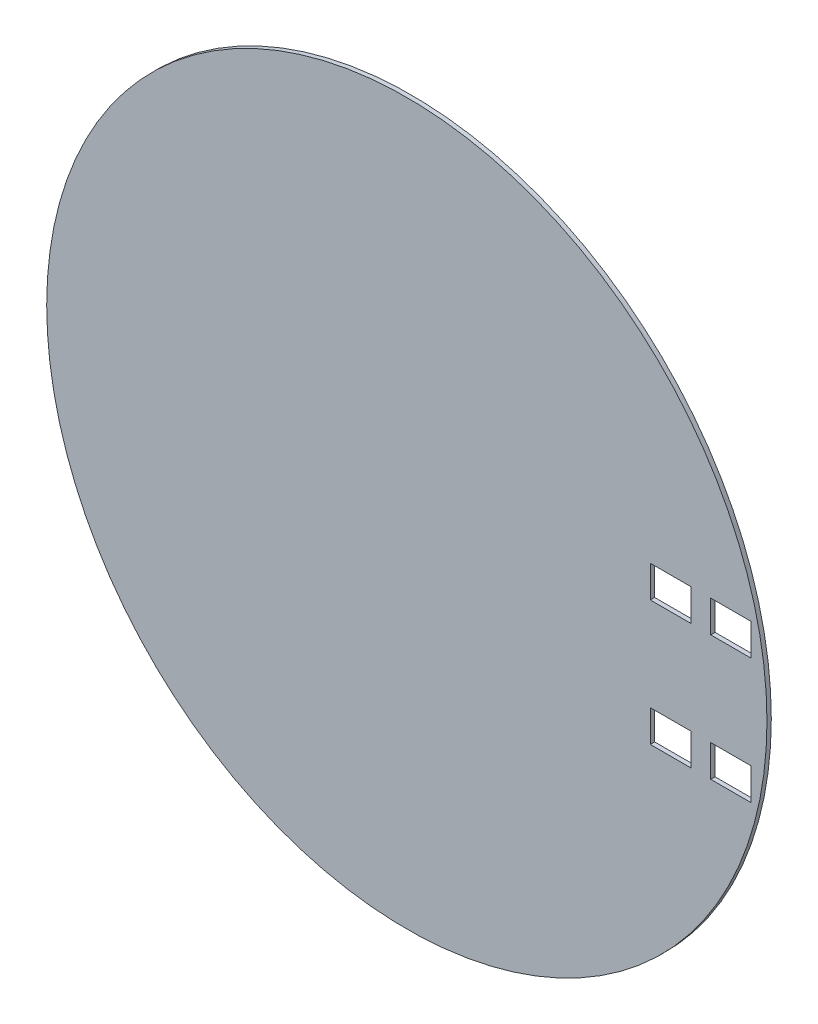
ISO-10303-21;
HEADER;
FILE_DESCRIPTION(('STEP AP214'),'2;1');
FILE_NAME('part.step','',(''),(''),'','','');
FILE_SCHEMA(('AUTOMOTIVE_DESIGN { 1 0 10303 214 1 1 1 1 }'));
ENDSEC;
DATA;
#1=APPLICATION_CONTEXT('core data for automotive mechanical design processes');
#2=APPLICATION_PROTOCOL_DEFINITION('international standard','automotive_design',2000,#1);
#3=PRODUCT_CONTEXT('',#1,'mechanical');
#4=PRODUCT('Part','Part','',(#3));
#5=PRODUCT_RELATED_PRODUCT_CATEGORY('part','',(#4));
#6=PRODUCT_DEFINITION_FORMATION('','',#4);
#7=PRODUCT_DEFINITION_CONTEXT('part definition',#1,'design');
#8=PRODUCT_DEFINITION('design','',#6,#7);
#9=PRODUCT_DEFINITION_SHAPE('','',#8);
#10=(LENGTH_UNIT() NAMED_UNIT(*) SI_UNIT(.MILLI.,.METRE.));
#11=(NAMED_UNIT(*) PLANE_ANGLE_UNIT() SI_UNIT($,.RADIAN.));
#12=(NAMED_UNIT(*) SI_UNIT($,.STERADIAN.) SOLID_ANGLE_UNIT());
#13=UNCERTAINTY_MEASURE_WITH_UNIT(LENGTH_MEASURE(1.E-05),#10,'distance_accuracy_value','');
#14=(GEOMETRIC_REPRESENTATION_CONTEXT(3) GLOBAL_UNCERTAINTY_ASSIGNED_CONTEXT((#13)) GLOBAL_UNIT_ASSIGNED_CONTEXT((#10,
#11,#12)) REPRESENTATION_CONTEXT('',''));
#15=CARTESIAN_POINT('',(0.,0.,0.));
#16=DIRECTION('',(0.,0.,1.));
#17=DIRECTION('',(1.,0.,0.));
#18=AXIS2_PLACEMENT_3D('',#15,#16,#17);
#19=CARTESIAN_POINT('',(0.,0.,1.8));
#20=DIRECTION('',(0.,0.,1.));
#21=DIRECTION('',(1.,0.,0.));
#22=AXIS2_PLACEMENT_3D('',#19,#20,#21);
#23=PLANE('',#22);
#24=CARTESIAN_POINT('',(0.,0.,1.8));
#25=DIRECTION('',(0.,0.,1.));
#26=DIRECTION('',(1.,0.,0.));
#27=AXIS2_PLACEMENT_3D('',#24,#25,#26);
#28=CIRCLE('',#27,24.9);
#29=CARTESIAN_POINT('',(24.9,0.,1.8));
#30=VERTEX_POINT('',#29);
#31=EDGE_CURVE('E244',#30,#30,#28,.T.);
#32=ORIENTED_EDGE('',*,*,#31,.T.);
#33=EDGE_LOOP('',(#32));
#34=FACE_BOUND('',#33,.T.);
#35=DIRECTION('',(-1.,0.,0.));
#36=VECTOR('',#35,1.);
#37=CARTESIAN_POINT('',(0.,-5.4251,1.8));
#38=LINE('',#37,#36);
#39=CARTESIAN_POINT('',(19.632,-5.4251,1.8));
#40=VERTEX_POINT('',#39);
#41=CARTESIAN_POINT('',(16.832,-5.4251,1.8));
#42=VERTEX_POINT('',#41);
#43=EDGE_CURVE('E233',#40,#42,#38,.T.);
#44=ORIENTED_EDGE('',*,*,#43,.T.);
#45=DIRECTION('',(0.,1.,0.));
#46=VECTOR('',#45,1.);
#47=CARTESIAN_POINT('',(16.832,0.,1.8));
#48=LINE('',#47,#46);
#49=CARTESIAN_POINT('',(16.832,-3.2251,1.8));
#50=VERTEX_POINT('',#49);
#51=EDGE_CURVE('E236',#42,#50,#48,.T.);
#52=ORIENTED_EDGE('',*,*,#51,.T.);
#53=DIRECTION('',(1.,0.,0.));
#54=VECTOR('',#53,1.);
#55=CARTESIAN_POINT('',(0.,-3.2251,1.8));
#56=LINE('',#55,#54);
#57=CARTESIAN_POINT('',(19.632,-3.2251,1.8));
#58=VERTEX_POINT('',#57);
#59=EDGE_CURVE('E226',#50,#58,#56,.T.);
#60=ORIENTED_EDGE('',*,*,#59,.T.);
#61=DIRECTION('',(0.,-1.,0.));
#62=VECTOR('',#61,1.);
#63=CARTESIAN_POINT('',(19.632,0.,1.8));
#64=LINE('',#63,#62);
#65=EDGE_CURVE('E234',#58,#40,#64,.T.);
#66=ORIENTED_EDGE('',*,*,#65,.T.);
#67=EDGE_LOOP('',(#44,#52,#60,#66));
#68=FACE_BOUND('',#67,.T.);
#69=DIRECTION('',(-1.,0.,0.));
#70=VECTOR('',#69,1.);
#71=CARTESIAN_POINT('',(0.,3.2251,1.8));
#72=LINE('',#71,#70);
#73=CARTESIAN_POINT('',(19.632,3.2251,1.8));
#74=VERTEX_POINT('',#73);
#75=CARTESIAN_POINT('',(16.832,3.2251,1.8));
#76=VERTEX_POINT('',#75);
#77=EDGE_CURVE('E215',#74,#76,#72,.T.);
#78=ORIENTED_EDGE('',*,*,#77,.T.);
#79=DIRECTION('',(0.,1.,0.));
#80=VECTOR('',#79,1.);
#81=CARTESIAN_POINT('',(16.832,0.,1.8));
#82=LINE('',#81,#80);
#83=CARTESIAN_POINT('',(16.832,5.4251,1.8));
#84=VERTEX_POINT('',#83);
#85=EDGE_CURVE('E214',#76,#84,#82,.T.);
#86=ORIENTED_EDGE('',*,*,#85,.T.);
#87=DIRECTION('',(1.,0.,0.));
#88=VECTOR('',#87,1.);
#89=CARTESIAN_POINT('',(0.,5.4251,1.8));
#90=LINE('',#89,#88);
#91=CARTESIAN_POINT('',(19.632,5.4251,1.8));
#92=VERTEX_POINT('',#91);
#93=EDGE_CURVE('E206',#84,#92,#90,.T.);
#94=ORIENTED_EDGE('',*,*,#93,.T.);
#95=DIRECTION('',(0.,-1.,0.));
#96=VECTOR('',#95,1.);
#97=CARTESIAN_POINT('',(19.632,0.,1.8));
#98=LINE('',#97,#96);
#99=EDGE_CURVE('E207',#92,#74,#98,.T.);
#100=ORIENTED_EDGE('',*,*,#99,.T.);
#101=EDGE_LOOP('',(#78,#86,#94,#100));
#102=FACE_BOUND('',#101,.T.);
#103=DIRECTION('',(-1.,0.,0.));
#104=VECTOR('',#103,1.);
#105=CARTESIAN_POINT('',(0.,-5.4251,1.8));
#106=LINE('',#105,#104);
#107=CARTESIAN_POINT('',(23.8118,-5.4251,1.8));
#108=VERTEX_POINT('',#107);
#109=CARTESIAN_POINT('',(21.0118,-5.4251,1.8));
#110=VERTEX_POINT('',#109);
#111=EDGE_CURVE('E186',#108,#110,#106,.T.);
#112=ORIENTED_EDGE('',*,*,#111,.T.);
#113=DIRECTION('',(0.,1.,0.));
#114=VECTOR('',#113,1.);
#115=CARTESIAN_POINT('',(21.0118,0.,1.8));
#116=LINE('',#115,#114);
#117=CARTESIAN_POINT('',(21.0118,-3.2251,1.8));
#118=VERTEX_POINT('',#117);
#119=EDGE_CURVE('E194',#110,#118,#116,.T.);
#120=ORIENTED_EDGE('',*,*,#119,.T.);
#121=DIRECTION('',(1.,0.,0.));
#122=VECTOR('',#121,1.);
#123=CARTESIAN_POINT('',(0.,-3.2251,1.8));
#124=LINE('',#123,#122);
#125=CARTESIAN_POINT('',(23.8118,-3.2251,1.8));
#126=VERTEX_POINT('',#125);
#127=EDGE_CURVE('E181',#118,#126,#124,.T.);
#128=ORIENTED_EDGE('',*,*,#127,.T.);
#129=DIRECTION('',(0.,-1.,0.));
#130=VECTOR('',#129,1.);
#131=CARTESIAN_POINT('',(23.8118,0.,1.8));
#132=LINE('',#131,#130);
#133=EDGE_CURVE('E187',#126,#108,#132,.T.);
#134=ORIENTED_EDGE('',*,*,#133,.T.);
#135=EDGE_LOOP('',(#112,#120,#128,#134));
#136=FACE_BOUND('',#135,.T.);
#137=DIRECTION('',(-1.,0.,0.));
#138=VECTOR('',#137,1.);
#139=CARTESIAN_POINT('',(0.,3.2251,1.8));
#140=LINE('',#139,#138);
#141=CARTESIAN_POINT('',(23.8118,3.2251,1.8));
#142=VERTEX_POINT('',#141);
#143=CARTESIAN_POINT('',(21.0118,3.2251,1.8));
#144=VERTEX_POINT('',#143);
#145=EDGE_CURVE('E170',#142,#144,#140,.T.);
#146=ORIENTED_EDGE('',*,*,#145,.T.);
#147=DIRECTION('',(0.,1.,0.));
#148=VECTOR('',#147,1.);
#149=CARTESIAN_POINT('',(21.0118,0.,1.8));
#150=LINE('',#149,#148);
#151=CARTESIAN_POINT('',(21.0118,5.4251,1.8));
#152=VERTEX_POINT('',#151);
#153=EDGE_CURVE('E161',#144,#152,#150,.T.);
#154=ORIENTED_EDGE('',*,*,#153,.T.);
#155=DIRECTION('',(1.,0.,0.));
#156=VECTOR('',#155,1.);
#157=CARTESIAN_POINT('',(0.,5.4251,1.8));
#158=LINE('',#157,#156);
#159=CARTESIAN_POINT('',(23.8118,5.4251,1.8));
#160=VERTEX_POINT('',#159);
#161=EDGE_CURVE('E147',#152,#160,#158,.T.);
#162=ORIENTED_EDGE('',*,*,#161,.T.);
#163=DIRECTION('',(0.,-1.,0.));
#164=VECTOR('',#163,1.);
#165=CARTESIAN_POINT('',(23.8118,0.,1.8));
#166=LINE('',#165,#164);
#167=EDGE_CURVE('E154',#160,#142,#166,.T.);
#168=ORIENTED_EDGE('',*,*,#167,.T.);
#169=EDGE_LOOP('',(#146,#154,#162,#168));
#170=FACE_BOUND('',#169,.T.);
#171=ADVANCED_FACE('F41',(#34,#68,#102,#136,#170),#23,.T.);
#172=CARTESIAN_POINT('',(0.,0.,1.5));
#173=DIRECTION('',(0.,0.,1.));
#174=DIRECTION('',(1.,0.,0.));
#175=AXIS2_PLACEMENT_3D('',#172,#173,#174);
#176=PLANE('',#175);
#177=DIRECTION('',(0.,1.,0.));
#178=VECTOR('',#177,1.);
#179=CARTESIAN_POINT('',(21.0118,0.,1.5));
#180=LINE('',#179,#178);
#181=CARTESIAN_POINT('',(21.0118,-5.4251,1.5));
#182=VERTEX_POINT('',#181);
#183=CARTESIAN_POINT('',(21.0118,-3.2251,1.5));
#184=VERTEX_POINT('',#183);
#185=EDGE_CURVE('E271',#182,#184,#180,.T.);
#186=ORIENTED_EDGE('',*,*,#185,.F.);
#187=DIRECTION('',(-1.,0.,0.));
#188=VECTOR('',#187,1.);
#189=CARTESIAN_POINT('',(0.,-5.4251,1.5));
#190=LINE('',#189,#188);
#191=CARTESIAN_POINT('',(23.8118,-5.4251,1.5));
#192=VERTEX_POINT('',#191);
#193=EDGE_CURVE('E267',#192,#182,#190,.T.);
#194=ORIENTED_EDGE('',*,*,#193,.F.);
#195=DIRECTION('',(0.,-1.,0.));
#196=VECTOR('',#195,1.);
#197=CARTESIAN_POINT('',(23.8118,0.,1.5));
#198=LINE('',#197,#196);
#199=CARTESIAN_POINT('',(23.8118,-3.2251,1.5));
#200=VERTEX_POINT('',#199);
#201=EDGE_CURVE('E270',#200,#192,#198,.T.);
#202=ORIENTED_EDGE('',*,*,#201,.F.);
#203=DIRECTION('',(1.,0.,0.));
#204=VECTOR('',#203,1.);
#205=CARTESIAN_POINT('',(0.,-3.2251,1.5));
#206=LINE('',#205,#204);
#207=EDGE_CURVE('E264',#184,#200,#206,.T.);
#208=ORIENTED_EDGE('',*,*,#207,.F.);
#209=EDGE_LOOP('',(#186,#194,#202,#208));
#210=FACE_BOUND('',#209,.T.);
#211=DIRECTION('',(0.,1.,0.));
#212=VECTOR('',#211,1.);
#213=CARTESIAN_POINT('',(16.832,0.,1.5));
#214=LINE('',#213,#212);
#215=CARTESIAN_POINT('',(16.832,-5.4251,1.5));
#216=VERTEX_POINT('',#215);
#217=CARTESIAN_POINT('',(16.832,-3.2251,1.5));
#218=VERTEX_POINT('',#217);
#219=EDGE_CURVE('E251',#216,#218,#214,.T.);
#220=ORIENTED_EDGE('',*,*,#219,.F.);
#221=DIRECTION('',(-1.,0.,0.));
#222=VECTOR('',#221,1.);
#223=CARTESIAN_POINT('',(0.,-5.4251,1.5));
#224=LINE('',#223,#222);
#225=CARTESIAN_POINT('',(19.632,-5.4251,1.5));
#226=VERTEX_POINT('',#225);
#227=EDGE_CURVE('E253',#226,#216,#224,.T.);
#228=ORIENTED_EDGE('',*,*,#227,.F.);
#229=DIRECTION('',(0.,-1.,0.));
#230=VECTOR('',#229,1.);
#231=CARTESIAN_POINT('',(19.632,0.,1.5));
#232=LINE('',#231,#230);
#233=CARTESIAN_POINT('',(19.632,-3.2251,1.5));
#234=VERTEX_POINT('',#233);
#235=EDGE_CURVE('E246',#234,#226,#232,.T.);
#236=ORIENTED_EDGE('',*,*,#235,.F.);
#237=DIRECTION('',(1.,0.,0.));
#238=VECTOR('',#237,1.);
#239=CARTESIAN_POINT('',(0.,-3.2251,1.5));
#240=LINE('',#239,#238);
#241=EDGE_CURVE('E243',#218,#234,#240,.T.);
#242=ORIENTED_EDGE('',*,*,#241,.F.);
#243=EDGE_LOOP('',(#220,#228,#236,#242));
#244=FACE_BOUND('',#243,.T.);
#245=CARTESIAN_POINT('',(0.,0.,1.5));
#246=DIRECTION('',(0.,0.,1.));
#247=DIRECTION('',(1.,0.,0.));
#248=AXIS2_PLACEMENT_3D('',#245,#246,#247);
#249=CIRCLE('',#248,24.9);
#250=CARTESIAN_POINT('',(24.9,0.,1.5));
#251=VERTEX_POINT('',#250);
#252=EDGE_CURVE('E242',#251,#251,#249,.T.);
#253=ORIENTED_EDGE('',*,*,#252,.F.);
#254=EDGE_LOOP('',(#253));
#255=FACE_BOUND('',#254,.T.);
#256=DIRECTION('',(0.,1.,0.));
#257=VECTOR('',#256,1.);
#258=CARTESIAN_POINT('',(16.832,0.,1.5));
#259=LINE('',#258,#257);
#260=CARTESIAN_POINT('',(16.832,3.2251,1.5));
#261=VERTEX_POINT('',#260);
#262=CARTESIAN_POINT('',(16.832,5.4251,1.5));
#263=VERTEX_POINT('',#262);
#264=EDGE_CURVE('E265',#261,#263,#259,.T.);
#265=ORIENTED_EDGE('',*,*,#264,.F.);
#266=DIRECTION('',(-1.,0.,0.));
#267=VECTOR('',#266,1.);
#268=CARTESIAN_POINT('',(0.,3.2251,1.5));
#269=LINE('',#268,#267);
#270=CARTESIAN_POINT('',(19.632,3.2251,1.5));
#271=VERTEX_POINT('',#270);
#272=EDGE_CURVE('E257',#271,#261,#269,.T.);
#273=ORIENTED_EDGE('',*,*,#272,.F.);
#274=DIRECTION('',(0.,-1.,0.));
#275=VECTOR('',#274,1.);
#276=CARTESIAN_POINT('',(19.632,0.,1.5));
#277=LINE('',#276,#275);
#278=CARTESIAN_POINT('',(19.632,5.4251,1.5));
#279=VERTEX_POINT('',#278);
#280=EDGE_CURVE('E256',#279,#271,#277,.T.);
#281=ORIENTED_EDGE('',*,*,#280,.F.);
#282=DIRECTION('',(1.,0.,0.));
#283=VECTOR('',#282,1.);
#284=CARTESIAN_POINT('',(0.,5.4251,1.5));
#285=LINE('',#284,#283);
#286=EDGE_CURVE('E258',#263,#279,#285,.T.);
#287=ORIENTED_EDGE('',*,*,#286,.F.);
#288=EDGE_LOOP('',(#265,#273,#281,#287));
#289=FACE_BOUND('',#288,.T.);
#290=DIRECTION('',(0.,1.,0.));
#291=VECTOR('',#290,1.);
#292=CARTESIAN_POINT('',(21.0118,0.,1.5));
#293=LINE('',#292,#291);
#294=CARTESIAN_POINT('',(21.0118,3.2251,1.5));
#295=VERTEX_POINT('',#294);
#296=CARTESIAN_POINT('',(21.0118,5.4251,1.5));
#297=VERTEX_POINT('',#296);
#298=EDGE_CURVE('E11',#295,#297,#293,.T.);
#299=ORIENTED_EDGE('',*,*,#298,.F.);
#300=DIRECTION('',(-1.,0.,0.));
#301=VECTOR('',#300,1.);
#302=CARTESIAN_POINT('',(0.,3.2251,1.5));
#303=LINE('',#302,#301);
#304=CARTESIAN_POINT('',(23.8118,3.2251,1.5));
#305=VERTEX_POINT('',#304);
#306=EDGE_CURVE('E47',#305,#295,#303,.T.);
#307=ORIENTED_EDGE('',*,*,#306,.F.);
#308=DIRECTION('',(0.,-1.,0.));
#309=VECTOR('',#308,1.);
#310=CARTESIAN_POINT('',(23.8118,0.,1.5));
#311=LINE('',#310,#309);
#312=CARTESIAN_POINT('',(23.8118,5.4251,1.5));
#313=VERTEX_POINT('',#312);
#314=EDGE_CURVE('E277',#313,#305,#311,.T.);
#315=ORIENTED_EDGE('',*,*,#314,.F.);
#316=DIRECTION('',(1.,0.,0.));
#317=VECTOR('',#316,1.);
#318=CARTESIAN_POINT('',(0.,5.4251,1.5));
#319=LINE('',#318,#317);
#320=EDGE_CURVE('E273',#297,#313,#319,.T.);
#321=ORIENTED_EDGE('',*,*,#320,.F.);
#322=EDGE_LOOP('',(#299,#307,#315,#321));
#323=FACE_BOUND('',#322,.T.);
#324=ADVANCED_FACE('F287',(#210,#244,#255,#289,#323),#176,.F.);
#325=CARTESIAN_POINT('',(0.,0.,1.8));
#326=DIRECTION('',(0.,0.,-1.));
#327=DIRECTION('',(-1.,0.,0.));
#328=AXIS2_PLACEMENT_3D('',#325,#326,#327);
#329=CYLINDRICAL_SURFACE('',#328,24.9);
#330=ORIENTED_EDGE('',*,*,#31,.F.);
#331=EDGE_LOOP('',(#330));
#332=FACE_BOUND('',#331,.T.);
#333=ORIENTED_EDGE('',*,*,#252,.T.);
#334=EDGE_LOOP('',(#333));
#335=FACE_BOUND('',#334,.T.);
#336=ADVANCED_FACE('F43',(#332,#335),#329,.T.);
#337=CARTESIAN_POINT('',(16.832,-5.4251,1.81));
#338=DIRECTION('',(1.,0.,0.));
#339=DIRECTION('',(0.,0.,-1.));
#340=AXIS2_PLACEMENT_3D('',#337,#338,#339);
#341=PLANE('',#340);
#342=DIRECTION('',(0.,0.,-1.));
#343=VECTOR('',#342,1.);
#344=CARTESIAN_POINT('',(16.832,-5.4251,1.81));
#345=LINE('',#344,#343);
#346=EDGE_CURVE('E227',#42,#216,#345,.T.);
#347=ORIENTED_EDGE('',*,*,#346,.T.);
#348=ORIENTED_EDGE('',*,*,#219,.T.);
#349=DIRECTION('',(0.,0.,-1.));
#350=VECTOR('',#349,1.);
#351=CARTESIAN_POINT('',(16.832,-3.2251,1.81));
#352=LINE('',#351,#350);
#353=EDGE_CURVE('E217',#50,#218,#352,.T.);
#354=ORIENTED_EDGE('',*,*,#353,.F.);
#355=ORIENTED_EDGE('',*,*,#51,.F.);
#356=EDGE_LOOP('',(#347,#348,#354,#355));
#357=FACE_BOUND('',#356,.T.);
#358=ADVANCED_FACE('F310',(#357),#341,.T.);
#359=CARTESIAN_POINT('',(16.832,-5.4251,1.81));
#360=DIRECTION('',(0.,1.,0.));
#361=DIRECTION('',(0.,0.,1.));
#362=AXIS2_PLACEMENT_3D('',#359,#360,#361);
#363=PLANE('',#362);
#364=DIRECTION('',(0.,0.,-1.));
#365=VECTOR('',#364,1.);
#366=CARTESIAN_POINT('',(19.632,-5.4251,1.81));
#367=LINE('',#366,#365);
#368=EDGE_CURVE('E224',#40,#226,#367,.T.);
#369=ORIENTED_EDGE('',*,*,#368,.T.);
#370=ORIENTED_EDGE('',*,*,#227,.T.);
#371=ORIENTED_EDGE('',*,*,#346,.F.);
#372=ORIENTED_EDGE('',*,*,#43,.F.);
#373=EDGE_LOOP('',(#369,#370,#371,#372));
#374=FACE_BOUND('',#373,.T.);
#375=ADVANCED_FACE('F315',(#374),#363,.T.);
#376=CARTESIAN_POINT('',(19.632,-5.4251,1.81));
#377=DIRECTION('',(-1.,0.,0.));
#378=DIRECTION('',(0.,0.,1.));
#379=AXIS2_PLACEMENT_3D('',#376,#377,#378);
#380=PLANE('',#379);
#381=DIRECTION('',(0.,0.,-1.));
#382=VECTOR('',#381,1.);
#383=CARTESIAN_POINT('',(19.632,-3.2251,1.81));
#384=LINE('',#383,#382);
#385=EDGE_CURVE('E219',#58,#234,#384,.T.);
#386=ORIENTED_EDGE('',*,*,#385,.T.);
#387=ORIENTED_EDGE('',*,*,#235,.T.);
#388=ORIENTED_EDGE('',*,*,#368,.F.);
#389=ORIENTED_EDGE('',*,*,#65,.F.);
#390=EDGE_LOOP('',(#386,#387,#388,#389));
#391=FACE_BOUND('',#390,.T.);
#392=ADVANCED_FACE('F316',(#391),#380,.T.);
#393=CARTESIAN_POINT('',(16.832,-3.2251,1.81));
#394=DIRECTION('',(0.,-1.,0.));
#395=DIRECTION('',(0.,0.,-1.));
#396=AXIS2_PLACEMENT_3D('',#393,#394,#395);
#397=PLANE('',#396);
#398=ORIENTED_EDGE('',*,*,#353,.T.);
#399=ORIENTED_EDGE('',*,*,#241,.T.);
#400=ORIENTED_EDGE('',*,*,#385,.F.);
#401=ORIENTED_EDGE('',*,*,#59,.F.);
#402=EDGE_LOOP('',(#398,#399,#400,#401));
#403=FACE_BOUND('',#402,.T.);
#404=ADVANCED_FACE('F319',(#403),#397,.T.);
#405=CARTESIAN_POINT('',(16.832,3.2251,1.81));
#406=DIRECTION('',(1.,0.,0.));
#407=DIRECTION('',(0.,0.,-1.));
#408=AXIS2_PLACEMENT_3D('',#405,#406,#407);
#409=PLANE('',#408);
#410=DIRECTION('',(0.,0.,-1.));
#411=VECTOR('',#410,1.);
#412=CARTESIAN_POINT('',(16.832,3.2251,1.81));
#413=LINE('',#412,#411);
#414=EDGE_CURVE('E201',#76,#261,#413,.T.);
#415=ORIENTED_EDGE('',*,*,#414,.T.);
#416=ORIENTED_EDGE('',*,*,#264,.T.);
#417=DIRECTION('',(0.,0.,-1.));
#418=VECTOR('',#417,1.);
#419=CARTESIAN_POINT('',(16.832,5.4251,1.81));
#420=LINE('',#419,#418);
#421=EDGE_CURVE('E193',#84,#263,#420,.T.);
#422=ORIENTED_EDGE('',*,*,#421,.F.);
#423=ORIENTED_EDGE('',*,*,#85,.F.);
#424=EDGE_LOOP('',(#415,#416,#422,#423));
#425=FACE_BOUND('',#424,.T.);
#426=ADVANCED_FACE('F322',(#425),#409,.T.);
#427=CARTESIAN_POINT('',(16.832,3.2251,1.81));
#428=DIRECTION('',(0.,1.,0.));
#429=DIRECTION('',(0.,0.,1.));
#430=AXIS2_PLACEMENT_3D('',#427,#428,#429);
#431=PLANE('',#430);
#432=DIRECTION('',(0.,0.,-1.));
#433=VECTOR('',#432,1.);
#434=CARTESIAN_POINT('',(19.632,3.2251,1.81));
#435=LINE('',#434,#433);
#436=EDGE_CURVE('E199',#74,#271,#435,.T.);
#437=ORIENTED_EDGE('',*,*,#436,.T.);
#438=ORIENTED_EDGE('',*,*,#272,.T.);
#439=ORIENTED_EDGE('',*,*,#414,.F.);
#440=ORIENTED_EDGE('',*,*,#77,.F.);
#441=EDGE_LOOP('',(#437,#438,#439,#440));
#442=FACE_BOUND('',#441,.T.);
#443=ADVANCED_FACE('F327',(#442),#431,.T.);
#444=CARTESIAN_POINT('',(19.632,3.2251,1.81));
#445=DIRECTION('',(-1.,0.,0.));
#446=DIRECTION('',(0.,0.,1.));
#447=AXIS2_PLACEMENT_3D('',#444,#445,#446);
#448=PLANE('',#447);
#449=DIRECTION('',(0.,0.,-1.));
#450=VECTOR('',#449,1.);
#451=CARTESIAN_POINT('',(19.632,5.4251,1.81));
#452=LINE('',#451,#450);
#453=EDGE_CURVE('E197',#92,#279,#452,.T.);
#454=ORIENTED_EDGE('',*,*,#453,.T.);
#455=ORIENTED_EDGE('',*,*,#280,.T.);
#456=ORIENTED_EDGE('',*,*,#436,.F.);
#457=ORIENTED_EDGE('',*,*,#99,.F.);
#458=EDGE_LOOP('',(#454,#455,#456,#457));
#459=FACE_BOUND('',#458,.T.);
#460=ADVANCED_FACE('F335',(#459),#448,.T.);
#461=CARTESIAN_POINT('',(16.832,5.4251,1.81));
#462=DIRECTION('',(0.,-1.,0.));
#463=DIRECTION('',(0.,0.,-1.));
#464=AXIS2_PLACEMENT_3D('',#461,#462,#463);
#465=PLANE('',#464);
#466=ORIENTED_EDGE('',*,*,#421,.T.);
#467=ORIENTED_EDGE('',*,*,#286,.T.);
#468=ORIENTED_EDGE('',*,*,#453,.F.);
#469=ORIENTED_EDGE('',*,*,#93,.F.);
#470=EDGE_LOOP('',(#466,#467,#468,#469));
#471=FACE_BOUND('',#470,.T.);
#472=ADVANCED_FACE('F337',(#471),#465,.T.);
#473=CARTESIAN_POINT('',(21.0118,-5.4251,1.81));
#474=DIRECTION('',(1.,0.,0.));
#475=DIRECTION('',(0.,0.,-1.));
#476=AXIS2_PLACEMENT_3D('',#473,#474,#475);
#477=PLANE('',#476);
#478=DIRECTION('',(0.,0.,-1.));
#479=VECTOR('',#478,1.);
#480=CARTESIAN_POINT('',(21.0118,-5.4251,1.81));
#481=LINE('',#480,#479);
#482=EDGE_CURVE('E178',#110,#182,#481,.T.);
#483=ORIENTED_EDGE('',*,*,#482,.T.);
#484=ORIENTED_EDGE('',*,*,#185,.T.);
#485=DIRECTION('',(0.,0.,-1.));
#486=VECTOR('',#485,1.);
#487=CARTESIAN_POINT('',(21.0118,-3.2251,1.81));
#488=LINE('',#487,#486);
#489=EDGE_CURVE('E169',#118,#184,#488,.T.);
#490=ORIENTED_EDGE('',*,*,#489,.F.);
#491=ORIENTED_EDGE('',*,*,#119,.F.);
#492=EDGE_LOOP('',(#483,#484,#490,#491));
#493=FACE_BOUND('',#492,.T.);
#494=ADVANCED_FACE('F338',(#493),#477,.T.);
#495=CARTESIAN_POINT('',(21.0118,-5.4251,1.81));
#496=DIRECTION('',(0.,1.,0.));
#497=DIRECTION('',(0.,0.,1.));
#498=AXIS2_PLACEMENT_3D('',#495,#496,#497);
#499=PLANE('',#498);
#500=DIRECTION('',(0.,0.,-1.));
#501=VECTOR('',#500,1.);
#502=CARTESIAN_POINT('',(23.8118,-5.4251,1.81));
#503=LINE('',#502,#501);
#504=EDGE_CURVE('E179',#108,#192,#503,.T.);
#505=ORIENTED_EDGE('',*,*,#504,.T.);
#506=ORIENTED_EDGE('',*,*,#193,.T.);
#507=ORIENTED_EDGE('',*,*,#482,.F.);
#508=ORIENTED_EDGE('',*,*,#111,.F.);
#509=EDGE_LOOP('',(#505,#506,#507,#508));
#510=FACE_BOUND('',#509,.T.);
#511=ADVANCED_FACE('F341',(#510),#499,.T.);
#512=CARTESIAN_POINT('',(23.8118,-5.4251,1.81));
#513=DIRECTION('',(-1.,0.,0.));
#514=DIRECTION('',(0.,0.,1.));
#515=AXIS2_PLACEMENT_3D('',#512,#513,#514);
#516=PLANE('',#515);
#517=DIRECTION('',(0.,0.,-1.));
#518=VECTOR('',#517,1.);
#519=CARTESIAN_POINT('',(23.8118,-3.2251,1.81));
#520=LINE('',#519,#518);
#521=EDGE_CURVE('E168',#126,#200,#520,.T.);
#522=ORIENTED_EDGE('',*,*,#521,.T.);
#523=ORIENTED_EDGE('',*,*,#201,.T.);
#524=ORIENTED_EDGE('',*,*,#504,.F.);
#525=ORIENTED_EDGE('',*,*,#133,.F.);
#526=EDGE_LOOP('',(#522,#523,#524,#525));
#527=FACE_BOUND('',#526,.T.);
#528=ADVANCED_FACE('F346',(#527),#516,.T.);
#529=CARTESIAN_POINT('',(21.0118,-3.2251,1.81));
#530=DIRECTION('',(0.,-1.,0.));
#531=DIRECTION('',(0.,0.,-1.));
#532=AXIS2_PLACEMENT_3D('',#529,#530,#531);
#533=PLANE('',#532);
#534=ORIENTED_EDGE('',*,*,#489,.T.);
#535=ORIENTED_EDGE('',*,*,#207,.T.);
#536=ORIENTED_EDGE('',*,*,#521,.F.);
#537=ORIENTED_EDGE('',*,*,#127,.F.);
#538=EDGE_LOOP('',(#534,#535,#536,#537));
#539=FACE_BOUND('',#538,.T.);
#540=ADVANCED_FACE('F354',(#539),#533,.T.);
#541=CARTESIAN_POINT('',(21.0118,3.2251,1.81));
#542=DIRECTION('',(1.,0.,0.));
#543=DIRECTION('',(0.,0.,-1.));
#544=AXIS2_PLACEMENT_3D('',#541,#542,#543);
#545=PLANE('',#544);
#546=DIRECTION('',(0.,0.,-1.));
#547=VECTOR('',#546,1.);
#548=CARTESIAN_POINT('',(21.0118,3.2251,1.81));
#549=LINE('',#548,#547);
#550=EDGE_CURVE('E156',#144,#295,#549,.T.);
#551=ORIENTED_EDGE('',*,*,#550,.T.);
#552=ORIENTED_EDGE('',*,*,#298,.T.);
#553=DIRECTION('',(0.,0.,-1.));
#554=VECTOR('',#553,1.);
#555=CARTESIAN_POINT('',(21.0118,5.4251,1.81));
#556=LINE('',#555,#554);
#557=EDGE_CURVE('E62',#152,#297,#556,.T.);
#558=ORIENTED_EDGE('',*,*,#557,.F.);
#559=ORIENTED_EDGE('',*,*,#153,.F.);
#560=EDGE_LOOP('',(#551,#552,#558,#559));
#561=FACE_BOUND('',#560,.T.);
#562=ADVANCED_FACE('F159',(#561),#545,.T.);
#563=CARTESIAN_POINT('',(21.0118,3.2251,1.81));
#564=DIRECTION('',(0.,1.,0.));
#565=DIRECTION('',(0.,0.,1.));
#566=AXIS2_PLACEMENT_3D('',#563,#564,#565);
#567=PLANE('',#566);
#568=DIRECTION('',(0.,0.,-1.));
#569=VECTOR('',#568,1.);
#570=CARTESIAN_POINT('',(23.8118,3.2251,1.81));
#571=LINE('',#570,#569);
#572=EDGE_CURVE('E284',#142,#305,#571,.T.);
#573=ORIENTED_EDGE('',*,*,#572,.T.);
#574=ORIENTED_EDGE('',*,*,#306,.T.);
#575=ORIENTED_EDGE('',*,*,#550,.F.);
#576=ORIENTED_EDGE('',*,*,#145,.F.);
#577=EDGE_LOOP('',(#573,#574,#575,#576));
#578=FACE_BOUND('',#577,.T.);
#579=ADVANCED_FACE('F278',(#578),#567,.T.);
#580=CARTESIAN_POINT('',(23.8118,3.2251,1.81));
#581=DIRECTION('',(-1.,0.,0.));
#582=DIRECTION('',(0.,0.,1.));
#583=AXIS2_PLACEMENT_3D('',#580,#581,#582);
#584=PLANE('',#583);
#585=DIRECTION('',(0.,0.,-1.));
#586=VECTOR('',#585,1.);
#587=CARTESIAN_POINT('',(23.8118,5.4251,1.81));
#588=LINE('',#587,#586);
#589=EDGE_CURVE('E57',#160,#313,#588,.T.);
#590=ORIENTED_EDGE('',*,*,#589,.T.);
#591=ORIENTED_EDGE('',*,*,#314,.T.);
#592=ORIENTED_EDGE('',*,*,#572,.F.);
#593=ORIENTED_EDGE('',*,*,#167,.F.);
#594=EDGE_LOOP('',(#590,#591,#592,#593));
#595=FACE_BOUND('',#594,.T.);
#596=ADVANCED_FACE('F290',(#595),#584,.T.);
#597=CARTESIAN_POINT('',(21.0118,5.4251,1.81));
#598=DIRECTION('',(0.,-1.,0.));
#599=DIRECTION('',(0.,0.,-1.));
#600=AXIS2_PLACEMENT_3D('',#597,#598,#599);
#601=PLANE('',#600);
#602=ORIENTED_EDGE('',*,*,#557,.T.);
#603=ORIENTED_EDGE('',*,*,#320,.T.);
#604=ORIENTED_EDGE('',*,*,#589,.F.);
#605=ORIENTED_EDGE('',*,*,#161,.F.);
#606=EDGE_LOOP('',(#602,#603,#604,#605));
#607=FACE_BOUND('',#606,.T.);
#608=ADVANCED_FACE('F151',(#607),#601,.T.);
#609=CLOSED_SHELL('',(#171,#324,#336,#358,#375,#392,#404,#426,#443,#460,#472,#494,#511,#528,
#540,#562,#579,#596,#608));
#610=MANIFOLD_SOLID_BREP('B2',#609);
#611=ADVANCED_BREP_SHAPE_REPRESENTATION('',(#18,#610),#14);
#612=SHAPE_DEFINITION_REPRESENTATION(#9,#611);
ENDSEC;
END-ISO-10303-21;
